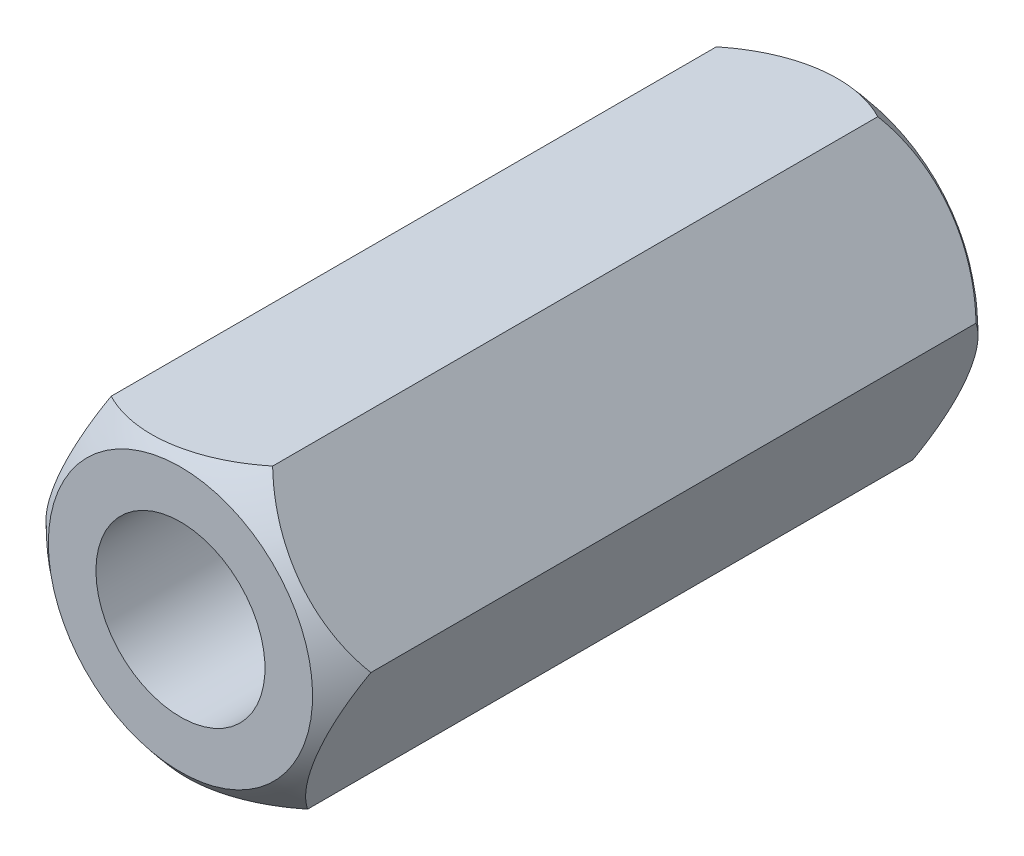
from build123d import *

# Parameters (mm, degrees)
EXTRUSION1_DEPTH   = 40
TROU_TARAUD_M121_D = 10.2


with BuildPart() as part:
    # Esquisse1 → Extrusion1 (new body)
    with BuildSketch(Plane.XY):
        Polygon((3.813132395, 9.043967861), (-5.925739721, 7.824253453), (-9.738872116, -1.219714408), (-3.813132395, -9.043967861), (5.925739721, -7.824253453), (9.738872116, 1.219714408), align=None)
    extrude(amount=EXTRUSION1_DEPTH)

    # Trou taraud_ M121 (through all)
    with Locations(Plane(origin=(0, 0, 0), x_dir=(-1, 0, 0), z_dir=(0, 0, -1))):
        with Locations((0, 0)):
            Hole(TROU_TARAUD_M121_D / 2)

    # Esquisse5 → Enl_vement de mati_re-R_volution1 (revolve, cut)
    with BuildSketch(Plane(origin=(0, 0, 0), x_dir=(1, 0, 0), z_dir=(0, 1, 0)), mode=Mode.PRIVATE) as enl_vement_de_mati_re_r_volution1_sk:
        with BuildLine():
            Line((0, 7.38932546), (0, 2.731180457))
            ThreePointArc((0, 2.731180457), (9.188017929, -1.07462118), (12.993819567, -10.26263911))
            Line((12.993819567, -10.26263911), (12.993819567, 7.38932546))
            Line((12.993819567, 7.38932546), (0, 7.38932546))
        make_face()
        with BuildLine():
            Line((12.993819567, -47.38932546), (12.993819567, -29.73736089))
            ThreePointArc((12.993819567, -29.73736089), (9.188017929, -38.92537882), (0, -42.731180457))
            Line((0, -42.731180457), (0, -47.38932546))
            Line((0, -47.38932546), (12.993819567, -47.38932546))
        make_face()
    revolve(enl_vement_de_mati_re_r_volution1_sk.sketch.rotate(Axis((0, 0, 10.26263911), (0, 0, -1)), 352.861339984), axis=Axis((0, 0, 10.26263911), (0, 0, -1)), mode=Mode.SUBTRACT)


solid = part.part
